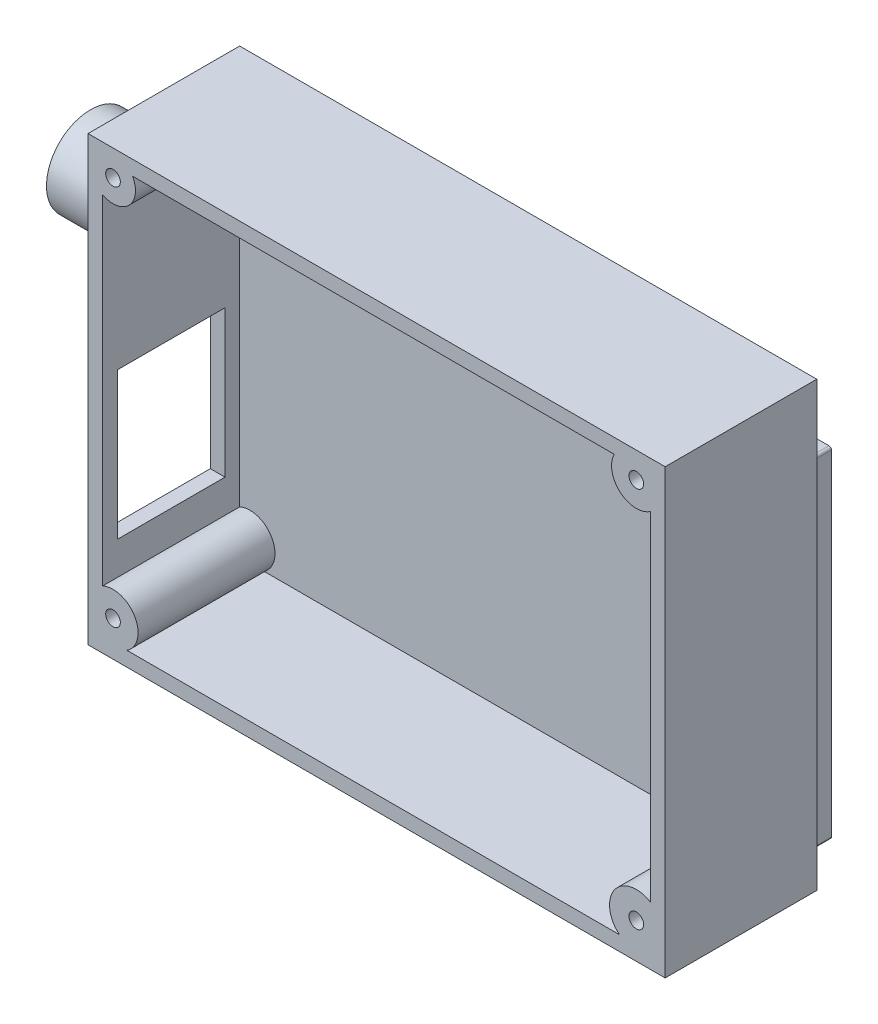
ISO-10303-21;
HEADER;
FILE_DESCRIPTION(('STEP AP214'),'2;1');
FILE_NAME('part.step','',(''),(''),'','','');
FILE_SCHEMA(('AUTOMOTIVE_DESIGN { 1 0 10303 214 1 1 1 1 }'));
ENDSEC;
DATA;
#1=APPLICATION_CONTEXT('core data for automotive mechanical design processes');
#2=APPLICATION_PROTOCOL_DEFINITION('international standard','automotive_design',2000,#1);
#3=PRODUCT_CONTEXT('',#1,'mechanical');
#4=PRODUCT('Part','Part','',(#3));
#5=PRODUCT_RELATED_PRODUCT_CATEGORY('part','',(#4));
#6=PRODUCT_DEFINITION_FORMATION('','',#4);
#7=PRODUCT_DEFINITION_CONTEXT('part definition',#1,'design');
#8=PRODUCT_DEFINITION('design','',#6,#7);
#9=PRODUCT_DEFINITION_SHAPE('','',#8);
#10=(LENGTH_UNIT() NAMED_UNIT(*) SI_UNIT(.MILLI.,.METRE.));
#11=(NAMED_UNIT(*) PLANE_ANGLE_UNIT() SI_UNIT($,.RADIAN.));
#12=(NAMED_UNIT(*) SI_UNIT($,.STERADIAN.) SOLID_ANGLE_UNIT());
#13=UNCERTAINTY_MEASURE_WITH_UNIT(LENGTH_MEASURE(1.E-05),#10,'distance_accuracy_value','');
#14=(GEOMETRIC_REPRESENTATION_CONTEXT(3) GLOBAL_UNCERTAINTY_ASSIGNED_CONTEXT((#13)) GLOBAL_UNIT_ASSIGNED_CONTEXT((#10,
#11,#12)) REPRESENTATION_CONTEXT('',''));
#15=CARTESIAN_POINT('',(0.,0.,0.));
#16=DIRECTION('',(0.,0.,1.));
#17=DIRECTION('',(1.,0.,0.));
#18=AXIS2_PLACEMENT_3D('',#15,#16,#17);
#19=CARTESIAN_POINT('',(-118.,0.,0.));
#20=DIRECTION('',(-1.,0.,0.));
#21=DIRECTION('',(0.,0.,1.));
#22=AXIS2_PLACEMENT_3D('',#19,#20,#21);
#23=PLANE('',#22);
#24=CARTESIAN_POINT('',(-118.,67.575,18.));
#25=DIRECTION('',(1.,0.,0.));
#26=DIRECTION('',(0.,0.,-1.));
#27=AXIS2_PLACEMENT_3D('',#24,#25,#26);
#28=CIRCLE('',#27,5.5);
#29=CARTESIAN_POINT('',(-118.,67.575,12.5));
#30=VERTEX_POINT('',#29);
#31=EDGE_CURVE('E413',#30,#30,#28,.F.);
#32=ORIENTED_EDGE('',*,*,#31,.T.);
#33=EDGE_LOOP('',(#32));
#34=FACE_BOUND('',#33,.T.);
#35=ADVANCED_FACE('F32',(#34),#23,.T.);
#36=CARTESIAN_POINT('',(0.,0.,15.));
#37=DIRECTION('',(0.,0.,1.));
#38=DIRECTION('',(1.,0.,0.));
#39=AXIS2_PLACEMENT_3D('',#36,#37,#38);
#40=PLANE('',#39);
#41=CARTESIAN_POINT('',(-112.8950577,5.828677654,15.));
#42=DIRECTION('',(0.,0.,1.));
#43=DIRECTION('',(1.,0.,0.));
#44=AXIS2_PLACEMENT_3D('',#41,#42,#43);
#45=CIRCLE('',#44,1.5);
#46=CARTESIAN_POINT('',(-111.3950577,5.828677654,15.));
#47=VERTEX_POINT('',#46);
#48=EDGE_CURVE('E410',#47,#47,#45,.T.);
#49=ORIENTED_EDGE('',*,*,#48,.T.);
#50=EDGE_LOOP('',(#49));
#51=FACE_BOUND('',#50,.T.);
#52=ADVANCED_FACE('F648',(#51),#40,.T.);
#53=CARTESIAN_POINT('',(0.,0.,15.));
#54=DIRECTION('',(0.,0.,1.));
#55=DIRECTION('',(1.,0.,0.));
#56=AXIS2_PLACEMENT_3D('',#53,#54,#55);
#57=PLANE('',#56);
#58=CARTESIAN_POINT('',(-5.895057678,83.82867765,15.));
#59=DIRECTION('',(0.,0.,1.));
#60=DIRECTION('',(1.,0.,0.));
#61=AXIS2_PLACEMENT_3D('',#58,#59,#60);
#62=CIRCLE('',#61,1.5);
#63=CARTESIAN_POINT('',(-4.395057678,83.82867765,15.));
#64=VERTEX_POINT('',#63);
#65=EDGE_CURVE('E407',#64,#64,#62,.T.);
#66=ORIENTED_EDGE('',*,*,#65,.T.);
#67=EDGE_LOOP('',(#66));
#68=FACE_BOUND('',#67,.T.);
#69=ADVANCED_FACE('F652',(#68),#57,.T.);
#70=CARTESIAN_POINT('',(0.,0.,15.));
#71=DIRECTION('',(0.,0.,1.));
#72=DIRECTION('',(1.,0.,0.));
#73=AXIS2_PLACEMENT_3D('',#70,#71,#72);
#74=PLANE('',#73);
#75=CARTESIAN_POINT('',(-112.8950577,83.82867765,15.));
#76=DIRECTION('',(0.,0.,1.));
#77=DIRECTION('',(1.,0.,0.));
#78=AXIS2_PLACEMENT_3D('',#75,#76,#77);
#79=CIRCLE('',#78,1.5);
#80=CARTESIAN_POINT('',(-111.3950577,83.82867765,15.));
#81=VERTEX_POINT('',#80);
#82=EDGE_CURVE('E369',#81,#81,#79,.T.);
#83=ORIENTED_EDGE('',*,*,#82,.T.);
#84=EDGE_LOOP('',(#83));
#85=FACE_BOUND('',#84,.T.);
#86=ADVANCED_FACE('F656',(#85),#74,.T.);
#87=CARTESIAN_POINT('',(0.,0.,15.));
#88=DIRECTION('',(0.,0.,1.));
#89=DIRECTION('',(1.,0.,0.));
#90=AXIS2_PLACEMENT_3D('',#87,#88,#89);
#91=PLANE('',#90);
#92=CARTESIAN_POINT('',(-5.895057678,5.828677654,15.));
#93=DIRECTION('',(0.,0.,1.));
#94=DIRECTION('',(1.,0.,0.));
#95=AXIS2_PLACEMENT_3D('',#92,#93,#94);
#96=CIRCLE('',#95,1.5);
#97=CARTESIAN_POINT('',(-4.395057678,5.828677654,15.));
#98=VERTEX_POINT('',#97);
#99=EDGE_CURVE('E398',#98,#98,#96,.T.);
#100=ORIENTED_EDGE('',*,*,#99,.T.);
#101=EDGE_LOOP('',(#100));
#102=FACE_BOUND('',#101,.T.);
#103=ADVANCED_FACE('F660',(#102),#91,.T.);
#104=CARTESIAN_POINT('',(-134.5,67.575,18.));
#105=DIRECTION('',(1.,0.,0.));
#106=DIRECTION('',(0.,0.,-1.));
#107=AXIS2_PLACEMENT_3D('',#104,#105,#106);
#108=CYLINDRICAL_SURFACE('',#107,5.5);
#109=CARTESIAN_POINT('',(-134.5,67.575,18.));
#110=DIRECTION('',(1.,0.,0.));
#111=DIRECTION('',(0.,0.,-1.));
#112=AXIS2_PLACEMENT_3D('',#109,#110,#111);
#113=CIRCLE('',#112,5.5);
#114=CARTESIAN_POINT('',(-134.5,67.575,12.5));
#115=VERTEX_POINT('',#114);
#116=EDGE_CURVE('E354',#115,#115,#113,.F.);
#117=ORIENTED_EDGE('',*,*,#116,.T.);
#118=EDGE_LOOP('',(#117));
#119=FACE_BOUND('',#118,.T.);
#120=ORIENTED_EDGE('',*,*,#31,.F.);
#121=EDGE_LOOP('',(#120));
#122=FACE_BOUND('',#121,.T.);
#123=ADVANCED_FACE('F664',(#119,#122),#108,.F.);
#124=CARTESIAN_POINT('',(0.,0.,7.));
#125=DIRECTION('',(0.,0.,-1.));
#126=DIRECTION('',(-1.,0.,0.));
#127=AXIS2_PLACEMENT_3D('',#124,#125,#126);
#128=PLANE('',#127);
#129=CARTESIAN_POINT('',(-5.895057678,5.828677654,7.));
#130=DIRECTION('',(0.,0.,-1.));
#131=DIRECTION('',(-1.,0.,0.));
#132=AXIS2_PLACEMENT_3D('',#129,#130,#131);
#133=CIRCLE('',#132,5.481741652);
#134=CARTESIAN_POINT('',(-9.35276183,1.575,7.));
#135=VERTEX_POINT('',#134);
#136=CARTESIAN_POINT('',(-3.,10.4835817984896,7.));
#137=VERTEX_POINT('',#136);
#138=EDGE_CURVE('E338',#135,#137,#133,.T.);
#139=ORIENTED_EDGE('',*,*,#138,.T.);
#140=DIRECTION('',(0.,1.,0.));
#141=VECTOR('',#140,1.);
#142=CARTESIAN_POINT('',(-3.,0.,7.));
#143=LINE('',#142,#141);
#144=CARTESIAN_POINT('',(-3.,79.67727759,7.));
#145=VERTEX_POINT('',#144);
#146=EDGE_CURVE('E334',#137,#145,#143,.T.);
#147=ORIENTED_EDGE('',*,*,#146,.T.);
#148=CARTESIAN_POINT('',(-5.895057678,83.82867765,7.));
#149=DIRECTION('',(0.,0.,-1.));
#150=DIRECTION('',(-1.,0.,0.));
#151=AXIS2_PLACEMENT_3D('',#148,#149,#150);
#152=CIRCLE('',#151,5.061173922);
#153=CARTESIAN_POINT('',(-10.4155020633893,86.10487272,7.));
#154=VERTEX_POINT('',#153);
#155=EDGE_CURVE('E363',#145,#154,#152,.T.);
#156=ORIENTED_EDGE('',*,*,#155,.T.);
#157=DIRECTION('',(1.,0.,0.));
#158=VECTOR('',#157,1.);
#159=CARTESIAN_POINT('',(0.,86.10487272,7.));
#160=LINE('',#159,#158);
#161=CARTESIAN_POINT('',(-108.901465,86.10487272,7.));
#162=VERTEX_POINT('',#161);
#163=EDGE_CURVE('E359',#154,#162,#160,.F.);
#164=ORIENTED_EDGE('',*,*,#163,.T.);
#165=CARTESIAN_POINT('',(-112.8950577,83.82867765,7.));
#166=DIRECTION('',(0.,0.,-1.));
#167=DIRECTION('',(-1.,0.,0.));
#168=AXIS2_PLACEMENT_3D('',#165,#166,#167);
#169=CIRCLE('',#168,4.5967213);
#170=CARTESIAN_POINT('',(-115.,79.7422287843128,7.));
#171=VERTEX_POINT('',#170);
#172=EDGE_CURVE('E358',#162,#171,#169,.T.);
#173=ORIENTED_EDGE('',*,*,#172,.T.);
#174=DIRECTION('',(0.,-1.,0.));
#175=VECTOR('',#174,1.);
#176=CARTESIAN_POINT('',(-115.,0.,7.));
#177=LINE('',#176,#175);
#178=CARTESIAN_POINT('',(-115.,10.49935057,7.));
#179=VERTEX_POINT('',#178);
#180=EDGE_CURVE('E350',#171,#179,#177,.T.);
#181=ORIENTED_EDGE('',*,*,#180,.T.);
#182=CARTESIAN_POINT('',(-112.8950577,5.828677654,7.));
#183=DIRECTION('',(0.,0.,-1.));
#184=DIRECTION('',(-1.,0.,0.));
#185=AXIS2_PLACEMENT_3D('',#182,#183,#184);
#186=CIRCLE('',#185,5.12308190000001);
#187=CARTESIAN_POINT('',(-110.039852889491,1.575,7.));
#188=VERTEX_POINT('',#187);
#189=EDGE_CURVE('E346',#179,#188,#186,.T.);
#190=ORIENTED_EDGE('',*,*,#189,.T.);
#191=DIRECTION('',(1.,0.,0.));
#192=VECTOR('',#191,1.);
#193=CARTESIAN_POINT('',(0.,1.575,7.));
#194=LINE('',#193,#192);
#195=EDGE_CURVE('E342',#188,#135,#194,.T.);
#196=ORIENTED_EDGE('',*,*,#195,.T.);
#197=EDGE_LOOP('',(#139,#147,#156,#164,#173,#181,#190,#196));
#198=FACE_BOUND('',#197,.T.);
#199=ADVANCED_FACE('F668',(#198),#128,.F.);
#200=CARTESIAN_POINT('',(-112.8950577,5.828677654,15.));
#201=DIRECTION('',(0.,0.,1.));
#202=DIRECTION('',(1.,0.,0.));
#203=AXIS2_PLACEMENT_3D('',#200,#201,#202);
#204=CYLINDRICAL_SURFACE('',#203,1.5);
#205=ORIENTED_EDGE('',*,*,#48,.F.);
#206=EDGE_LOOP('',(#205));
#207=FACE_BOUND('',#206,.T.);
#208=CARTESIAN_POINT('',(-112.8950577,5.828677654,35.));
#209=DIRECTION('',(0.,0.,1.));
#210=DIRECTION('',(1.,0.,0.));
#211=AXIS2_PLACEMENT_3D('',#208,#209,#210);
#212=CIRCLE('',#211,1.5);
#213=CARTESIAN_POINT('',(-111.3950577,5.828677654,35.));
#214=VERTEX_POINT('',#213);
#215=EDGE_CURVE('E390',#214,#214,#212,.T.);
#216=ORIENTED_EDGE('',*,*,#215,.T.);
#217=EDGE_LOOP('',(#216));
#218=FACE_BOUND('',#217,.T.);
#219=ADVANCED_FACE('F672',(#207,#218),#204,.F.);
#220=CARTESIAN_POINT('',(-5.895057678,83.82867765,15.));
#221=DIRECTION('',(0.,0.,1.));
#222=DIRECTION('',(1.,0.,0.));
#223=AXIS2_PLACEMENT_3D('',#220,#221,#222);
#224=CYLINDRICAL_SURFACE('',#223,1.5);
#225=ORIENTED_EDGE('',*,*,#65,.F.);
#226=EDGE_LOOP('',(#225));
#227=FACE_BOUND('',#226,.T.);
#228=CARTESIAN_POINT('',(-5.89505767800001,83.82867765,35.));
#229=DIRECTION('',(0.,0.,1.));
#230=DIRECTION('',(1.,0.,0.));
#231=AXIS2_PLACEMENT_3D('',#228,#229,#230);
#232=CIRCLE('',#231,1.5);
#233=CARTESIAN_POINT('',(-4.39505767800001,83.82867765,35.));
#234=VERTEX_POINT('',#233);
#235=EDGE_CURVE('E387',#234,#234,#232,.T.);
#236=ORIENTED_EDGE('',*,*,#235,.T.);
#237=EDGE_LOOP('',(#236));
#238=FACE_BOUND('',#237,.T.);
#239=ADVANCED_FACE('F676',(#227,#238),#224,.F.);
#240=CARTESIAN_POINT('',(-5.895057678,83.82867765,35.));
#241=DIRECTION('',(0.,0.,-1.));
#242=DIRECTION('',(-1.,0.,0.));
#243=AXIS2_PLACEMENT_3D('',#240,#241,#242);
#244=CYLINDRICAL_SURFACE('',#243,5.061173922);
#245=CARTESIAN_POINT('',(-5.895057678,83.82867765,35.));
#246=DIRECTION('',(0.,0.,-1.));
#247=DIRECTION('',(-1.,0.,0.));
#248=AXIS2_PLACEMENT_3D('',#245,#246,#247);
#249=CIRCLE('',#248,5.061173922);
#250=CARTESIAN_POINT('',(-3.,79.67727759,35.));
#251=VERTEX_POINT('',#250);
#252=CARTESIAN_POINT('',(-10.4155020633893,86.10487272,35.));
#253=VERTEX_POINT('',#252);
#254=EDGE_CURVE('E314',#251,#253,#249,.T.);
#255=ORIENTED_EDGE('',*,*,#254,.T.);
#256=DIRECTION('',(0.,0.,1.));
#257=VECTOR('',#256,1.);
#258=CARTESIAN_POINT('',(-10.41550206,86.10487272,0.));
#259=LINE('',#258,#257);
#260=EDGE_CURVE('E360',#253,#154,#259,.F.);
#261=ORIENTED_EDGE('',*,*,#260,.T.);
#262=ORIENTED_EDGE('',*,*,#155,.F.);
#263=DIRECTION('',(0.,0.,-1.));
#264=VECTOR('',#263,1.);
#265=CARTESIAN_POINT('',(-3.,79.67727759,0.));
#266=LINE('',#265,#264);
#267=EDGE_CURVE('E335',#145,#251,#266,.F.);
#268=ORIENTED_EDGE('',*,*,#267,.T.);
#269=EDGE_LOOP('',(#255,#261,#262,#268));
#270=FACE_BOUND('',#269,.T.);
#271=ADVANCED_FACE('F680',(#270),#244,.T.);
#272=CARTESIAN_POINT('',(0.,86.10487272,0.));
#273=DIRECTION('',(0.,1.,0.));
#274=DIRECTION('',(0.,0.,1.));
#275=AXIS2_PLACEMENT_3D('',#272,#273,#274);
#276=PLANE('',#275);
#277=ORIENTED_EDGE('',*,*,#260,.F.);
#278=DIRECTION('',(-1.,0.,0.));
#279=VECTOR('',#278,1.);
#280=CARTESIAN_POINT('',(0.,86.10487272,35.));
#281=LINE('',#280,#279);
#282=CARTESIAN_POINT('',(-108.901465,86.10487272,35.));
#283=VERTEX_POINT('',#282);
#284=EDGE_CURVE('E311',#253,#283,#281,.T.);
#285=ORIENTED_EDGE('',*,*,#284,.T.);
#286=DIRECTION('',(0.,0.,-1.));
#287=VECTOR('',#286,1.);
#288=CARTESIAN_POINT('',(-108.901465,86.10487272,21.));
#289=LINE('',#288,#287);
#290=EDGE_CURVE('E355',#283,#162,#289,.T.);
#291=ORIENTED_EDGE('',*,*,#290,.T.);
#292=ORIENTED_EDGE('',*,*,#163,.F.);
#293=EDGE_LOOP('',(#277,#285,#291,#292));
#294=FACE_BOUND('',#293,.T.);
#295=ADVANCED_FACE('F684',(#294),#276,.F.);
#296=CARTESIAN_POINT('',(-112.8950577,83.82867765,35.));
#297=DIRECTION('',(0.,0.,-1.));
#298=DIRECTION('',(-1.,0.,0.));
#299=AXIS2_PLACEMENT_3D('',#296,#297,#298);
#300=CYLINDRICAL_SURFACE('',#299,4.5967213);
#301=CARTESIAN_POINT('',(-112.8950577,83.82867765,35.));
#302=DIRECTION('',(0.,0.,-1.));
#303=DIRECTION('',(-1.,0.,0.));
#304=AXIS2_PLACEMENT_3D('',#301,#302,#303);
#305=CIRCLE('',#304,4.5967213);
#306=CARTESIAN_POINT('',(-115.,79.7422287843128,35.));
#307=VERTEX_POINT('',#306);
#308=EDGE_CURVE('E310',#283,#307,#305,.T.);
#309=ORIENTED_EDGE('',*,*,#308,.T.);
#310=DIRECTION('',(0.,0.,1.));
#311=VECTOR('',#310,1.);
#312=CARTESIAN_POINT('',(-115.,79.74222882,0.));
#313=LINE('',#312,#311);
#314=EDGE_CURVE('E347',#307,#171,#313,.F.);
#315=ORIENTED_EDGE('',*,*,#314,.T.);
#316=ORIENTED_EDGE('',*,*,#172,.F.);
#317=ORIENTED_EDGE('',*,*,#290,.F.);
#318=EDGE_LOOP('',(#309,#315,#316,#317));
#319=FACE_BOUND('',#318,.T.);
#320=ADVANCED_FACE('F688',(#319),#300,.T.);
#321=CARTESIAN_POINT('',(-112.8950577,5.828677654,35.));
#322=DIRECTION('',(0.,0.,-1.));
#323=DIRECTION('',(-1.,0.,0.));
#324=AXIS2_PLACEMENT_3D('',#321,#322,#323);
#325=CYLINDRICAL_SURFACE('',#324,5.12308190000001);
#326=CARTESIAN_POINT('',(-112.8950577,5.828677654,35.));
#327=DIRECTION('',(0.,0.,-1.));
#328=DIRECTION('',(-1.,0.,0.));
#329=AXIS2_PLACEMENT_3D('',#326,#327,#328);
#330=CIRCLE('',#329,5.12308190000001);
#331=CARTESIAN_POINT('',(-115.,10.49935057,35.));
#332=VERTEX_POINT('',#331);
#333=CARTESIAN_POINT('',(-110.039852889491,1.575,35.));
#334=VERTEX_POINT('',#333);
#335=EDGE_CURVE('E306',#332,#334,#330,.T.);
#336=ORIENTED_EDGE('',*,*,#335,.T.);
#337=DIRECTION('',(0.,0.,-1.));
#338=VECTOR('',#337,1.);
#339=CARTESIAN_POINT('',(-110.0398529,1.575,0.));
#340=LINE('',#339,#338);
#341=EDGE_CURVE('E343',#334,#188,#340,.T.);
#342=ORIENTED_EDGE('',*,*,#341,.T.);
#343=ORIENTED_EDGE('',*,*,#189,.F.);
#344=DIRECTION('',(0.,0.,1.));
#345=VECTOR('',#344,1.);
#346=CARTESIAN_POINT('',(-115.,10.49935057,0.));
#347=LINE('',#346,#345);
#348=EDGE_CURVE('E351',#179,#332,#347,.T.);
#349=ORIENTED_EDGE('',*,*,#348,.T.);
#350=EDGE_LOOP('',(#336,#342,#343,#349));
#351=FACE_BOUND('',#350,.T.);
#352=ADVANCED_FACE('F692',(#351),#325,.T.);
#353=CARTESIAN_POINT('',(0.,1.575,0.));
#354=DIRECTION('',(0.,-1.,0.));
#355=DIRECTION('',(0.,0.,-1.));
#356=AXIS2_PLACEMENT_3D('',#353,#354,#355);
#357=PLANE('',#356);
#358=ORIENTED_EDGE('',*,*,#341,.F.);
#359=DIRECTION('',(-1.,0.,0.));
#360=VECTOR('',#359,1.);
#361=CARTESIAN_POINT('',(0.,1.575,35.));
#362=LINE('',#361,#360);
#363=CARTESIAN_POINT('',(-9.35276183,1.575,35.));
#364=VERTEX_POINT('',#363);
#365=EDGE_CURVE('E303',#334,#364,#362,.F.);
#366=ORIENTED_EDGE('',*,*,#365,.T.);
#367=DIRECTION('',(0.,0.,-1.));
#368=VECTOR('',#367,1.);
#369=CARTESIAN_POINT('',(-9.35276183,1.575,21.));
#370=LINE('',#369,#368);
#371=EDGE_CURVE('E339',#364,#135,#370,.T.);
#372=ORIENTED_EDGE('',*,*,#371,.T.);
#373=ORIENTED_EDGE('',*,*,#195,.F.);
#374=EDGE_LOOP('',(#358,#366,#372,#373));
#375=FACE_BOUND('',#374,.T.);
#376=ADVANCED_FACE('F696',(#375),#357,.F.);
#377=CARTESIAN_POINT('',(-5.895057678,5.828677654,35.));
#378=DIRECTION('',(0.,0.,-1.));
#379=DIRECTION('',(-1.,0.,0.));
#380=AXIS2_PLACEMENT_3D('',#377,#378,#379);
#381=CYLINDRICAL_SURFACE('',#380,5.481741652);
#382=CARTESIAN_POINT('',(-5.895057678,5.828677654,35.));
#383=DIRECTION('',(0.,0.,-1.));
#384=DIRECTION('',(-1.,0.,0.));
#385=AXIS2_PLACEMENT_3D('',#382,#383,#384);
#386=CIRCLE('',#385,5.481741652);
#387=CARTESIAN_POINT('',(-3.,10.4835817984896,35.));
#388=VERTEX_POINT('',#387);
#389=EDGE_CURVE('E302',#364,#388,#386,.T.);
#390=ORIENTED_EDGE('',*,*,#389,.T.);
#391=DIRECTION('',(0.,0.,-1.));
#392=VECTOR('',#391,1.);
#393=CARTESIAN_POINT('',(-3.,10.4835818,0.));
#394=LINE('',#393,#392);
#395=EDGE_CURVE('E331',#388,#137,#394,.T.);
#396=ORIENTED_EDGE('',*,*,#395,.T.);
#397=ORIENTED_EDGE('',*,*,#138,.F.);
#398=ORIENTED_EDGE('',*,*,#371,.F.);
#399=EDGE_LOOP('',(#390,#396,#397,#398));
#400=FACE_BOUND('',#399,.T.);
#401=ADVANCED_FACE('F700',(#400),#381,.T.);
#402=CARTESIAN_POINT('',(-3.,0.,0.));
#403=DIRECTION('',(1.,0.,0.));
#404=DIRECTION('',(0.,0.,-1.));
#405=AXIS2_PLACEMENT_3D('',#402,#403,#404);
#406=PLANE('',#405);
#407=ORIENTED_EDGE('',*,*,#395,.F.);
#408=DIRECTION('',(0.,1.,0.));
#409=VECTOR('',#408,1.);
#410=CARTESIAN_POINT('',(-3.,0.,35.));
#411=LINE('',#410,#409);
#412=EDGE_CURVE('E298',#388,#251,#411,.T.);
#413=ORIENTED_EDGE('',*,*,#412,.T.);
#414=ORIENTED_EDGE('',*,*,#267,.F.);
#415=ORIENTED_EDGE('',*,*,#146,.F.);
#416=EDGE_LOOP('',(#407,#413,#414,#415));
#417=FACE_BOUND('',#416,.T.);
#418=ADVANCED_FACE('F704',(#417),#406,.F.);
#419=CARTESIAN_POINT('',(-112.8950577,83.82867765,15.));
#420=DIRECTION('',(0.,0.,1.));
#421=DIRECTION('',(1.,0.,0.));
#422=AXIS2_PLACEMENT_3D('',#419,#420,#421);
#423=CYLINDRICAL_SURFACE('',#422,1.5);
#424=ORIENTED_EDGE('',*,*,#82,.F.);
#425=EDGE_LOOP('',(#424));
#426=FACE_BOUND('',#425,.T.);
#427=CARTESIAN_POINT('',(-112.8950577,83.82867765,35.));
#428=DIRECTION('',(0.,0.,1.));
#429=DIRECTION('',(1.,0.,0.));
#430=AXIS2_PLACEMENT_3D('',#427,#428,#429);
#431=CIRCLE('',#430,1.5);
#432=CARTESIAN_POINT('',(-111.3950577,83.82867765,35.));
#433=VERTEX_POINT('',#432);
#434=EDGE_CURVE('E301',#433,#433,#431,.T.);
#435=ORIENTED_EDGE('',*,*,#434,.T.);
#436=EDGE_LOOP('',(#435));
#437=FACE_BOUND('',#436,.T.);
#438=ADVANCED_FACE('F708',(#426,#437),#423,.F.);
#439=CARTESIAN_POINT('',(-5.895057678,5.828677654,15.));
#440=DIRECTION('',(0.,0.,1.));
#441=DIRECTION('',(1.,0.,0.));
#442=AXIS2_PLACEMENT_3D('',#439,#440,#441);
#443=CYLINDRICAL_SURFACE('',#442,1.5);
#444=ORIENTED_EDGE('',*,*,#99,.F.);
#445=EDGE_LOOP('',(#444));
#446=FACE_BOUND('',#445,.T.);
#447=CARTESIAN_POINT('',(-5.89505767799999,5.828677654,35.));
#448=DIRECTION('',(0.,0.,1.));
#449=DIRECTION('',(1.,0.,0.));
#450=AXIS2_PLACEMENT_3D('',#447,#448,#449);
#451=CIRCLE('',#450,1.5);
#452=CARTESIAN_POINT('',(-4.39505767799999,5.828677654,35.));
#453=VERTEX_POINT('',#452);
#454=EDGE_CURVE('E378',#453,#453,#451,.T.);
#455=ORIENTED_EDGE('',*,*,#454,.T.);
#456=EDGE_LOOP('',(#455));
#457=FACE_BOUND('',#456,.T.);
#458=ADVANCED_FACE('F712',(#446,#457),#443,.F.);
#459=CARTESIAN_POINT('',(-134.5,0.,0.));
#460=DIRECTION('',(1.,0.,0.));
#461=DIRECTION('',(0.,0.,-1.));
#462=AXIS2_PLACEMENT_3D('',#459,#460,#461);
#463=PLANE('',#462);
#464=ORIENTED_EDGE('',*,*,#116,.F.);
#465=EDGE_LOOP('',(#464));
#466=FACE_BOUND('',#465,.T.);
#467=CARTESIAN_POINT('',(-134.5,67.575,18.));
#468=DIRECTION('',(1.,0.,0.));
#469=DIRECTION('',(0.,0.,-1.));
#470=AXIS2_PLACEMENT_3D('',#467,#468,#469);
#471=CIRCLE('',#470,9.);
#472=CARTESIAN_POINT('',(-134.5,67.575,9.));
#473=VERTEX_POINT('',#472);
#474=EDGE_CURVE('E297',#473,#473,#471,.F.);
#475=ORIENTED_EDGE('',*,*,#474,.T.);
#476=EDGE_LOOP('',(#475));
#477=FACE_BOUND('',#476,.T.);
#478=ADVANCED_FACE('F716',(#466,#477),#463,.F.);
#479=CARTESIAN_POINT('',(-115.,0.,0.));
#480=DIRECTION('',(-1.,0.,0.));
#481=DIRECTION('',(0.,-1.,0.));
#482=AXIS2_PLACEMENT_3D('',#479,#480,#481);
#483=PLANE('',#482);
#484=DIRECTION('',(0.,0.,-1.));
#485=VECTOR('',#484,1.);
#486=CARTESIAN_POINT('',(-115.,47.25941139,0.));
#487=LINE('',#486,#485);
#488=CARTESIAN_POINT('',(-115.,47.25941139,32.));
#489=VERTEX_POINT('',#488);
#490=CARTESIAN_POINT('',(-115.,47.25941139,10.));
#491=VERTEX_POINT('',#490);
#492=EDGE_CURVE('E290',#489,#491,#487,.T.);
#493=ORIENTED_EDGE('',*,*,#492,.T.);
#494=DIRECTION('',(0.,1.,0.));
#495=VECTOR('',#494,1.);
#496=CARTESIAN_POINT('',(-115.,0.,10.));
#497=LINE('',#496,#495);
#498=CARTESIAN_POINT('',(-115.,17.25941139,10.));
#499=VERTEX_POINT('',#498);
#500=EDGE_CURVE('E226',#491,#499,#497,.F.);
#501=ORIENTED_EDGE('',*,*,#500,.T.);
#502=DIRECTION('',(0.,0.,1.));
#503=VECTOR('',#502,1.);
#504=CARTESIAN_POINT('',(-115.,17.25941139,0.));
#505=LINE('',#504,#503);
#506=CARTESIAN_POINT('',(-115.,17.25941139,32.));
#507=VERTEX_POINT('',#506);
#508=EDGE_CURVE('E225',#499,#507,#505,.T.);
#509=ORIENTED_EDGE('',*,*,#508,.T.);
#510=DIRECTION('',(0.,1.,0.));
#511=VECTOR('',#510,1.);
#512=CARTESIAN_POINT('',(-115.,0.,32.));
#513=LINE('',#512,#511);
#514=EDGE_CURVE('E295',#507,#489,#513,.T.);
#515=ORIENTED_EDGE('',*,*,#514,.T.);
#516=EDGE_LOOP('',(#493,#501,#509,#515));
#517=FACE_BOUND('',#516,.T.);
#518=ORIENTED_EDGE('',*,*,#314,.F.);
#519=DIRECTION('',(0.,1.,0.));
#520=VECTOR('',#519,1.);
#521=CARTESIAN_POINT('',(-115.,0.,35.));
#522=LINE('',#521,#520);
#523=EDGE_CURVE('E307',#307,#332,#522,.F.);
#524=ORIENTED_EDGE('',*,*,#523,.T.);
#525=ORIENTED_EDGE('',*,*,#348,.F.);
#526=ORIENTED_EDGE('',*,*,#180,.F.);
#527=EDGE_LOOP('',(#518,#524,#525,#526));
#528=FACE_BOUND('',#527,.T.);
#529=ADVANCED_FACE('F720',(#517,#528),#483,.F.);
#530=CARTESIAN_POINT('',(-112.8950577,5.828677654,35.));
#531=DIRECTION('',(0.,0.,-1.));
#532=DIRECTION('',(-1.,0.,0.));
#533=AXIS2_PLACEMENT_3D('',#530,#531,#532);
#534=CYLINDRICAL_SURFACE('',#533,5.12308180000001);
#535=CARTESIAN_POINT('',(-112.8950577,5.828677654,4.));
#536=DIRECTION('',(0.,0.,-1.));
#537=DIRECTION('',(-1.,0.,0.));
#538=AXIS2_PLACEMENT_3D('',#535,#536,#537);
#539=CIRCLE('',#538,5.12308180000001);
#540=CARTESIAN_POINT('',(-118.,5.397943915,4.));
#541=VERTEX_POINT('',#540);
#542=CARTESIAN_POINT('',(-118.,6.25941121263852,4.));
#543=VERTEX_POINT('',#542);
#544=EDGE_CURVE('E366',#541,#543,#539,.T.);
#545=ORIENTED_EDGE('',*,*,#544,.F.);
#546=DIRECTION('',(0.,0.,1.));
#547=VECTOR('',#546,1.);
#548=CARTESIAN_POINT('',(-118.,5.397943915,0.));
#549=LINE('',#548,#547);
#550=CARTESIAN_POINT('',(-118.,5.397943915,35.));
#551=VERTEX_POINT('',#550);
#552=EDGE_CURVE('E282',#541,#551,#549,.T.);
#553=ORIENTED_EDGE('',*,*,#552,.T.);
#554=CARTESIAN_POINT('',(-112.8950577,5.828677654,35.));
#555=DIRECTION('',(0.,0.,-1.));
#556=DIRECTION('',(-1.,0.,0.));
#557=AXIS2_PLACEMENT_3D('',#554,#555,#556);
#558=CIRCLE('',#557,5.12308180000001);
#559=CARTESIAN_POINT('',(-118.,6.25941121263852,35.));
#560=VERTEX_POINT('',#559);
#561=EDGE_CURVE('E393',#551,#560,#558,.T.);
#562=ORIENTED_EDGE('',*,*,#561,.T.);
#563=DIRECTION('',(0.,0.,1.));
#564=VECTOR('',#563,1.);
#565=CARTESIAN_POINT('',(-118.,6.259411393,0.));
#566=LINE('',#565,#564);
#567=EDGE_CURVE('E242',#560,#543,#566,.F.);
#568=ORIENTED_EDGE('',*,*,#567,.T.);
#569=EDGE_LOOP('',(#545,#553,#562,#568));
#570=FACE_BOUND('',#569,.T.);
#571=ADVANCED_FACE('F500',(#570),#534,.T.);
#572=CARTESIAN_POINT('',(0.,0.,35.));
#573=DIRECTION('',(0.,0.,-1.));
#574=DIRECTION('',(-1.,0.,0.));
#575=AXIS2_PLACEMENT_3D('',#572,#573,#574);
#576=PLANE('',#575);
#577=ORIENTED_EDGE('',*,*,#454,.F.);
#578=EDGE_LOOP('',(#577));
#579=FACE_BOUND('',#578,.T.);
#580=ORIENTED_EDGE('',*,*,#434,.F.);
#581=EDGE_LOOP('',(#580));
#582=FACE_BOUND('',#581,.T.);
#583=ORIENTED_EDGE('',*,*,#389,.F.);
#584=ORIENTED_EDGE('',*,*,#365,.F.);
#585=ORIENTED_EDGE('',*,*,#335,.F.);
#586=ORIENTED_EDGE('',*,*,#523,.F.);
#587=ORIENTED_EDGE('',*,*,#308,.F.);
#588=ORIENTED_EDGE('',*,*,#284,.F.);
#589=ORIENTED_EDGE('',*,*,#254,.F.);
#590=ORIENTED_EDGE('',*,*,#412,.F.);
#591=EDGE_LOOP('',(#583,#584,#585,#586,#587,#588,#589,#590));
#592=FACE_BOUND('',#591,.T.);
#593=ORIENTED_EDGE('',*,*,#235,.F.);
#594=EDGE_LOOP('',(#593));
#595=FACE_BOUND('',#594,.T.);
#596=ORIENTED_EDGE('',*,*,#215,.F.);
#597=EDGE_LOOP('',(#596));
#598=FACE_BOUND('',#597,.T.);
#599=ORIENTED_EDGE('',*,*,#561,.F.);
#600=DIRECTION('',(0.,1.,0.));
#601=VECTOR('',#600,1.);
#602=CARTESIAN_POINT('',(-118.,0.,35.));
#603=LINE('',#602,#601);
#604=CARTESIAN_POINT('',(-118.,-1.425,35.));
#605=VERTEX_POINT('',#604);
#606=EDGE_CURVE('E279',#551,#605,#603,.F.);
#607=ORIENTED_EDGE('',*,*,#606,.T.);
#608=DIRECTION('',(1.,0.,0.));
#609=VECTOR('',#608,1.);
#610=CARTESIAN_POINT('',(0.,-1.425,35.));
#611=LINE('',#610,#609);
#612=CARTESIAN_POINT('',(0.,-1.425,35.));
#613=VERTEX_POINT('',#612);
#614=EDGE_CURVE('E270',#605,#613,#611,.T.);
#615=ORIENTED_EDGE('',*,*,#614,.T.);
#616=DIRECTION('',(0.,1.,0.));
#617=VECTOR('',#616,1.);
#618=CARTESIAN_POINT('',(0.,0.,35.));
#619=LINE('',#618,#617);
#620=CARTESIAN_POINT('',(0.,89.10487272,35.));
#621=VERTEX_POINT('',#620);
#622=EDGE_CURVE('E261',#613,#621,#619,.T.);
#623=ORIENTED_EDGE('',*,*,#622,.T.);
#624=DIRECTION('',(1.,0.,0.));
#625=VECTOR('',#624,1.);
#626=CARTESIAN_POINT('',(0.,89.10487272,35.));
#627=LINE('',#626,#625);
#628=CARTESIAN_POINT('',(-118.,89.10487272,35.));
#629=VERTEX_POINT('',#628);
#630=EDGE_CURVE('E246',#621,#629,#627,.F.);
#631=ORIENTED_EDGE('',*,*,#630,.T.);
#632=DIRECTION('',(0.,1.,0.));
#633=VECTOR('',#632,1.);
#634=CARTESIAN_POINT('',(-118.,0.,35.));
#635=LINE('',#634,#633);
#636=EDGE_CURVE('E249',#629,#560,#635,.F.);
#637=ORIENTED_EDGE('',*,*,#636,.T.);
#638=EDGE_LOOP('',(#599,#607,#615,#623,#631,#637));
#639=FACE_BOUND('',#638,.T.);
#640=ADVANCED_FACE('F503',(#579,#582,#592,#595,#598,#639),#576,.F.);
#641=CARTESIAN_POINT('',(-134.5,67.575,18.));
#642=DIRECTION('',(1.,0.,0.));
#643=DIRECTION('',(0.,0.,-1.));
#644=AXIS2_PLACEMENT_3D('',#641,#642,#643);
#645=CYLINDRICAL_SURFACE('',#644,9.);
#646=ORIENTED_EDGE('',*,*,#474,.F.);
#647=EDGE_LOOP('',(#646));
#648=FACE_BOUND('',#647,.T.);
#649=CARTESIAN_POINT('',(-118.,67.575,18.));
#650=DIRECTION('',(1.,0.,0.));
#651=DIRECTION('',(0.,0.,-1.));
#652=AXIS2_PLACEMENT_3D('',#649,#650,#651);
#653=CIRCLE('',#652,9.);
#654=CARTESIAN_POINT('',(-118.,67.575,9.));
#655=VERTEX_POINT('',#654);
#656=EDGE_CURVE('E241',#655,#655,#653,.F.);
#657=ORIENTED_EDGE('',*,*,#656,.T.);
#658=EDGE_LOOP('',(#657));
#659=FACE_BOUND('',#658,.T.);
#660=ADVANCED_FACE('F729',(#648,#659),#645,.T.);
#661=CARTESIAN_POINT('',(0.,0.,32.));
#662=DIRECTION('',(0.,0.,-1.));
#663=DIRECTION('',(-1.,0.,0.));
#664=AXIS2_PLACEMENT_3D('',#661,#662,#663);
#665=PLANE('',#664);
#666=DIRECTION('',(1.,0.,0.));
#667=VECTOR('',#666,1.);
#668=CARTESIAN_POINT('',(0.,47.25941139,32.));
#669=LINE('',#668,#667);
#670=CARTESIAN_POINT('',(-118.,47.25941139,32.));
#671=VERTEX_POINT('',#670);
#672=EDGE_CURVE('E292',#671,#489,#669,.T.);
#673=ORIENTED_EDGE('',*,*,#672,.T.);
#674=ORIENTED_EDGE('',*,*,#514,.F.);
#675=DIRECTION('',(1.,0.,0.));
#676=VECTOR('',#675,1.);
#677=CARTESIAN_POINT('',(0.,17.25941139,32.));
#678=LINE('',#677,#676);
#679=CARTESIAN_POINT('',(-118.,17.25941139,32.));
#680=VERTEX_POINT('',#679);
#681=EDGE_CURVE('E285',#507,#680,#678,.F.);
#682=ORIENTED_EDGE('',*,*,#681,.T.);
#683=DIRECTION('',(0.,1.,0.));
#684=VECTOR('',#683,1.);
#685=CARTESIAN_POINT('',(-118.,0.,32.));
#686=LINE('',#685,#684);
#687=EDGE_CURVE('E230',#680,#671,#686,.T.);
#688=ORIENTED_EDGE('',*,*,#687,.T.);
#689=EDGE_LOOP('',(#673,#674,#682,#688));
#690=FACE_BOUND('',#689,.T.);
#691=ADVANCED_FACE('F733',(#690),#665,.T.);
#692=CARTESIAN_POINT('',(0.,47.25941139,0.));
#693=DIRECTION('',(0.,-1.,0.));
#694=DIRECTION('',(0.,0.,-1.));
#695=AXIS2_PLACEMENT_3D('',#692,#693,#694);
#696=PLANE('',#695);
#697=DIRECTION('',(1.,0.,0.));
#698=VECTOR('',#697,1.);
#699=CARTESIAN_POINT('',(0.,47.25941139,10.));
#700=LINE('',#699,#698);
#701=CARTESIAN_POINT('',(-118.,47.25941139,10.));
#702=VERTEX_POINT('',#701);
#703=EDGE_CURVE('E213',#702,#491,#700,.T.);
#704=ORIENTED_EDGE('',*,*,#703,.T.);
#705=ORIENTED_EDGE('',*,*,#492,.F.);
#706=ORIENTED_EDGE('',*,*,#672,.F.);
#707=DIRECTION('',(0.,0.,1.));
#708=VECTOR('',#707,1.);
#709=CARTESIAN_POINT('',(-118.,47.25941139,0.));
#710=LINE('',#709,#708);
#711=EDGE_CURVE('E218',#671,#702,#710,.F.);
#712=ORIENTED_EDGE('',*,*,#711,.T.);
#713=EDGE_LOOP('',(#704,#705,#706,#712));
#714=FACE_BOUND('',#713,.T.);
#715=ADVANCED_FACE('F737',(#714),#696,.T.);
#716=CARTESIAN_POINT('',(0.,0.,10.));
#717=DIRECTION('',(0.,0.,1.));
#718=DIRECTION('',(1.,0.,0.));
#719=AXIS2_PLACEMENT_3D('',#716,#717,#718);
#720=PLANE('',#719);
#721=DIRECTION('',(1.,0.,0.));
#722=VECTOR('',#721,1.);
#723=CARTESIAN_POINT('',(0.,17.25941139,10.));
#724=LINE('',#723,#722);
#725=CARTESIAN_POINT('',(-118.,17.25941139,10.));
#726=VERTEX_POINT('',#725);
#727=EDGE_CURVE('E210',#726,#499,#724,.T.);
#728=ORIENTED_EDGE('',*,*,#727,.T.);
#729=ORIENTED_EDGE('',*,*,#500,.F.);
#730=ORIENTED_EDGE('',*,*,#703,.F.);
#731=DIRECTION('',(0.,1.,0.));
#732=VECTOR('',#731,1.);
#733=CARTESIAN_POINT('',(-118.,0.,10.));
#734=LINE('',#733,#732);
#735=EDGE_CURVE('E206',#702,#726,#734,.F.);
#736=ORIENTED_EDGE('',*,*,#735,.T.);
#737=EDGE_LOOP('',(#728,#729,#730,#736));
#738=FACE_BOUND('',#737,.T.);
#739=ADVANCED_FACE('F208',(#738),#720,.T.);
#740=CARTESIAN_POINT('',(0.,17.25941139,0.));
#741=DIRECTION('',(0.,1.,0.));
#742=DIRECTION('',(0.,0.,1.));
#743=AXIS2_PLACEMENT_3D('',#740,#741,#742);
#744=PLANE('',#743);
#745=ORIENTED_EDGE('',*,*,#681,.F.);
#746=ORIENTED_EDGE('',*,*,#508,.F.);
#747=ORIENTED_EDGE('',*,*,#727,.F.);
#748=DIRECTION('',(0.,0.,1.));
#749=VECTOR('',#748,1.);
#750=CARTESIAN_POINT('',(-118.,17.25941139,0.));
#751=LINE('',#750,#749);
#752=EDGE_CURVE('E217',#726,#680,#751,.T.);
#753=ORIENTED_EDGE('',*,*,#752,.T.);
#754=EDGE_LOOP('',(#745,#746,#747,#753));
#755=FACE_BOUND('',#754,.T.);
#756=ADVANCED_FACE('F223',(#755),#744,.T.);
#757=CARTESIAN_POINT('',(-118.,0.,0.));
#758=DIRECTION('',(-1.,0.,0.));
#759=DIRECTION('',(0.,0.,1.));
#760=AXIS2_PLACEMENT_3D('',#757,#758,#759);
#761=PLANE('',#760);
#762=DIRECTION('',(0.,0.,-1.));
#763=VECTOR('',#762,1.);
#764=CARTESIAN_POINT('',(-118.,-1.425,0.));
#765=LINE('',#764,#763);
#766=CARTESIAN_POINT('',(-118.,-1.425,4.));
#767=VERTEX_POINT('',#766);
#768=EDGE_CURVE('E276',#767,#605,#765,.F.);
#769=ORIENTED_EDGE('',*,*,#768,.T.);
#770=ORIENTED_EDGE('',*,*,#606,.F.);
#771=ORIENTED_EDGE('',*,*,#552,.F.);
#772=DIRECTION('',(0.,1.,0.));
#773=VECTOR('',#772,1.);
#774=CARTESIAN_POINT('',(-118.,0.,4.));
#775=LINE('',#774,#773);
#776=EDGE_CURVE('E231',#541,#767,#775,.F.);
#777=ORIENTED_EDGE('',*,*,#776,.T.);
#778=EDGE_LOOP('',(#769,#770,#771,#777));
#779=FACE_BOUND('',#778,.T.);
#780=ADVANCED_FACE('F517',(#779),#761,.T.);
#781=CARTESIAN_POINT('',(0.,-1.425,0.));
#782=DIRECTION('',(0.,-1.,0.));
#783=DIRECTION('',(0.,0.,-1.));
#784=AXIS2_PLACEMENT_3D('',#781,#782,#783);
#785=PLANE('',#784);
#786=ORIENTED_EDGE('',*,*,#614,.F.);
#787=ORIENTED_EDGE('',*,*,#768,.F.);
#788=DIRECTION('',(-1.,0.,0.));
#789=VECTOR('',#788,1.);
#790=CARTESIAN_POINT('',(0.,-1.425,4.));
#791=LINE('',#790,#789);
#792=CARTESIAN_POINT('',(0.,-1.425,4.));
#793=VERTEX_POINT('',#792);
#794=EDGE_CURVE('E233',#767,#793,#791,.F.);
#795=ORIENTED_EDGE('',*,*,#794,.T.);
#796=DIRECTION('',(0.,0.,-1.));
#797=VECTOR('',#796,1.);
#798=CARTESIAN_POINT('',(0.,-1.425,0.));
#799=LINE('',#798,#797);
#800=EDGE_CURVE('E267',#793,#613,#799,.F.);
#801=ORIENTED_EDGE('',*,*,#800,.T.);
#802=EDGE_LOOP('',(#786,#787,#795,#801));
#803=FACE_BOUND('',#802,.T.);
#804=ADVANCED_FACE('F515',(#803),#785,.T.);
#805=CARTESIAN_POINT('',(0.,0.,0.));
#806=DIRECTION('',(1.,0.,0.));
#807=DIRECTION('',(0.,0.,-1.));
#808=AXIS2_PLACEMENT_3D('',#805,#806,#807);
#809=PLANE('',#808);
#810=ORIENTED_EDGE('',*,*,#622,.F.);
#811=ORIENTED_EDGE('',*,*,#800,.F.);
#812=DIRECTION('',(0.,1.,0.));
#813=VECTOR('',#812,1.);
#814=CARTESIAN_POINT('',(0.,0.,4.));
#815=LINE('',#814,#813);
#816=CARTESIAN_POINT('',(0.,89.10487272,4.));
#817=VERTEX_POINT('',#816);
#818=EDGE_CURVE('E255',#793,#817,#815,.T.);
#819=ORIENTED_EDGE('',*,*,#818,.T.);
#820=DIRECTION('',(0.,0.,1.));
#821=VECTOR('',#820,1.);
#822=CARTESIAN_POINT('',(0.,89.10487272,0.));
#823=LINE('',#822,#821);
#824=EDGE_CURVE('E258',#817,#621,#823,.T.);
#825=ORIENTED_EDGE('',*,*,#824,.T.);
#826=EDGE_LOOP('',(#810,#811,#819,#825));
#827=FACE_BOUND('',#826,.T.);
#828=ADVANCED_FACE('F510',(#827),#809,.T.);
#829=CARTESIAN_POINT('',(0.,89.10487272,0.));
#830=DIRECTION('',(0.,1.,0.));
#831=DIRECTION('',(0.,0.,1.));
#832=AXIS2_PLACEMENT_3D('',#829,#830,#831);
#833=PLANE('',#832);
#834=ORIENTED_EDGE('',*,*,#630,.F.);
#835=ORIENTED_EDGE('',*,*,#824,.F.);
#836=DIRECTION('',(-1.,0.,0.));
#837=VECTOR('',#836,1.);
#838=CARTESIAN_POINT('',(0.,89.10487272,4.));
#839=LINE('',#838,#837);
#840=CARTESIAN_POINT('',(-118.,89.10487272,4.));
#841=VERTEX_POINT('',#840);
#842=EDGE_CURVE('E252',#817,#841,#839,.T.);
#843=ORIENTED_EDGE('',*,*,#842,.T.);
#844=DIRECTION('',(0.,0.,1.));
#845=VECTOR('',#844,1.);
#846=CARTESIAN_POINT('',(-118.,89.10487272,0.));
#847=LINE('',#846,#845);
#848=EDGE_CURVE('E245',#841,#629,#847,.T.);
#849=ORIENTED_EDGE('',*,*,#848,.T.);
#850=EDGE_LOOP('',(#834,#835,#843,#849));
#851=FACE_BOUND('',#850,.T.);
#852=ADVANCED_FACE('F508',(#851),#833,.T.);
#853=CARTESIAN_POINT('',(-118.,0.,0.));
#854=DIRECTION('',(-1.,0.,0.));
#855=DIRECTION('',(0.,0.,1.));
#856=AXIS2_PLACEMENT_3D('',#853,#854,#855);
#857=PLANE('',#856);
#858=ORIENTED_EDGE('',*,*,#735,.F.);
#859=ORIENTED_EDGE('',*,*,#711,.F.);
#860=ORIENTED_EDGE('',*,*,#687,.F.);
#861=ORIENTED_EDGE('',*,*,#752,.F.);
#862=EDGE_LOOP('',(#858,#859,#860,#861));
#863=FACE_BOUND('',#862,.T.);
#864=ORIENTED_EDGE('',*,*,#656,.F.);
#865=EDGE_LOOP('',(#864));
#866=FACE_BOUND('',#865,.T.);
#867=ORIENTED_EDGE('',*,*,#848,.F.);
#868=DIRECTION('',(0.,1.,0.));
#869=VECTOR('',#868,1.);
#870=CARTESIAN_POINT('',(-118.,0.,4.));
#871=LINE('',#870,#869);
#872=EDGE_CURVE('E254',#841,#543,#871,.F.);
#873=ORIENTED_EDGE('',*,*,#872,.T.);
#874=ORIENTED_EDGE('',*,*,#567,.F.);
#875=ORIENTED_EDGE('',*,*,#636,.F.);
#876=EDGE_LOOP('',(#867,#873,#874,#875));
#877=FACE_BOUND('',#876,.T.);
#878=ADVANCED_FACE('F228',(#863,#866,#877),#857,.T.);
#879=CARTESIAN_POINT('',(0.,0.,4.));
#880=DIRECTION('',(0.,0.,-1.));
#881=DIRECTION('',(-1.,0.,0.));
#882=AXIS2_PLACEMENT_3D('',#879,#880,#881);
#883=PLANE('',#882);
#884=DIRECTION('',(0.,1.,0.));
#885=VECTOR('',#884,1.);
#886=CARTESIAN_POINT('',(-83.,74.5749999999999,4.));
#887=LINE('',#886,#885);
#888=CARTESIAN_POINT('',(-83.,5.575,4.));
#889=VERTEX_POINT('',#888);
#890=CARTESIAN_POINT('',(-83.,74.0749999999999,4.));
#891=VERTEX_POINT('',#890);
#892=EDGE_CURVE('E454',#889,#891,#887,.T.);
#893=ORIENTED_EDGE('',*,*,#892,.F.);
#894=CARTESIAN_POINT('',(-82.5,5.575,4.));
#895=DIRECTION('',(0.,0.,-1.));
#896=DIRECTION('',(-1.,0.,0.));
#897=AXIS2_PLACEMENT_3D('',#894,#895,#896);
#898=CIRCLE('',#897,0.5);
#899=CARTESIAN_POINT('',(-82.5,5.075,4.));
#900=VERTEX_POINT('',#899);
#901=EDGE_CURVE('E40',#889,#900,#898,.F.);
#902=ORIENTED_EDGE('',*,*,#901,.T.);
#903=DIRECTION('',(1.,0.,0.));
#904=VECTOR('',#903,1.);
#905=CARTESIAN_POINT('',(0.,5.075,4.));
#906=LINE('',#905,#904);
#907=CARTESIAN_POINT('',(-1.5,5.075,4.));
#908=VERTEX_POINT('',#907);
#909=EDGE_CURVE('E236',#900,#908,#906,.T.);
#910=ORIENTED_EDGE('',*,*,#909,.T.);
#911=CARTESIAN_POINT('',(-1.5,5.575,4.));
#912=DIRECTION('',(0.,0.,-1.));
#913=DIRECTION('',(-1.,0.,0.));
#914=AXIS2_PLACEMENT_3D('',#911,#912,#913);
#915=CIRCLE('',#914,0.5);
#916=CARTESIAN_POINT('',(-1.,5.575,4.));
#917=VERTEX_POINT('',#916);
#918=EDGE_CURVE('E445',#908,#917,#915,.F.);
#919=ORIENTED_EDGE('',*,*,#918,.T.);
#920=DIRECTION('',(0.,1.,0.));
#921=VECTOR('',#920,1.);
#922=CARTESIAN_POINT('',(-1.,0.,4.));
#923=LINE('',#922,#921);
#924=CARTESIAN_POINT('',(-1.,74.0749999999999,4.));
#925=VERTEX_POINT('',#924);
#926=EDGE_CURVE('E462',#917,#925,#923,.T.);
#927=ORIENTED_EDGE('',*,*,#926,.T.);
#928=CARTESIAN_POINT('',(-1.5,74.0749999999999,4.));
#929=DIRECTION('',(0.,0.,-1.));
#930=DIRECTION('',(-1.,0.,0.));
#931=AXIS2_PLACEMENT_3D('',#928,#929,#930);
#932=CIRCLE('',#931,0.5);
#933=CARTESIAN_POINT('',(-1.5,74.5749999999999,4.));
#934=VERTEX_POINT('',#933);
#935=EDGE_CURVE('E447',#925,#934,#932,.F.);
#936=ORIENTED_EDGE('',*,*,#935,.T.);
#937=DIRECTION('',(1.,0.,0.));
#938=VECTOR('',#937,1.);
#939=CARTESIAN_POINT('',(-0.999999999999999,74.5749999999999,4.));
#940=LINE('',#939,#938);
#941=CARTESIAN_POINT('',(-82.5,74.5749999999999,4.));
#942=VERTEX_POINT('',#941);
#943=EDGE_CURVE('E416',#942,#934,#940,.T.);
#944=ORIENTED_EDGE('',*,*,#943,.F.);
#945=CARTESIAN_POINT('',(-82.5,74.0749999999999,4.));
#946=DIRECTION('',(0.,0.,-1.));
#947=DIRECTION('',(-1.,0.,0.));
#948=AXIS2_PLACEMENT_3D('',#945,#946,#947);
#949=CIRCLE('',#948,0.5);
#950=EDGE_CURVE('E11',#942,#891,#949,.F.);
#951=ORIENTED_EDGE('',*,*,#950,.T.);
#952=EDGE_LOOP('',(#893,#902,#910,#919,#927,#936,#944,#951));
#953=FACE_BOUND('',#952,.T.);
#954=ORIENTED_EDGE('',*,*,#842,.F.);
#955=ORIENTED_EDGE('',*,*,#818,.F.);
#956=ORIENTED_EDGE('',*,*,#794,.F.);
#957=ORIENTED_EDGE('',*,*,#776,.F.);
#958=ORIENTED_EDGE('',*,*,#544,.T.);
#959=ORIENTED_EDGE('',*,*,#872,.F.);
#960=EDGE_LOOP('',(#954,#955,#956,#957,#958,#959));
#961=FACE_BOUND('',#960,.T.);
#962=ADVANCED_FACE('F451',(#953,#961),#883,.T.);
#963=CARTESIAN_POINT('',(0.,5.075,0.));
#964=DIRECTION('',(0.,-1.,0.));
#965=DIRECTION('',(0.,0.,-1.));
#966=AXIS2_PLACEMENT_3D('',#963,#964,#965);
#967=PLANE('',#966);
#968=DIRECTION('',(-1.,0.,0.));
#969=VECTOR('',#968,1.);
#970=CARTESIAN_POINT('',(0.,5.075,0.));
#971=LINE('',#970,#969);
#972=CARTESIAN_POINT('',(-82.5,5.075,0.));
#973=VERTEX_POINT('',#972);
#974=CARTESIAN_POINT('',(-1.5,5.075,0.));
#975=VERTEX_POINT('',#974);
#976=EDGE_CURVE('E469',#973,#975,#971,.F.);
#977=ORIENTED_EDGE('',*,*,#976,.T.);
#978=DIRECTION('',(0.,0.,-1.));
#979=VECTOR('',#978,1.);
#980=CARTESIAN_POINT('',(-1.5,5.075,0.));
#981=LINE('',#980,#979);
#982=EDGE_CURVE('E434',#975,#908,#981,.F.);
#983=ORIENTED_EDGE('',*,*,#982,.T.);
#984=ORIENTED_EDGE('',*,*,#909,.F.);
#985=DIRECTION('',(0.,0.,-1.));
#986=VECTOR('',#985,1.);
#987=CARTESIAN_POINT('',(-82.5,5.075,0.));
#988=LINE('',#987,#986);
#989=EDGE_CURVE('E431',#900,#973,#988,.T.);
#990=ORIENTED_EDGE('',*,*,#989,.T.);
#991=EDGE_LOOP('',(#977,#983,#984,#990));
#992=FACE_BOUND('',#991,.T.);
#993=ADVANCED_FACE('F459',(#992),#967,.T.);
#994=CARTESIAN_POINT('',(-1.,0.,0.));
#995=DIRECTION('',(1.,0.,0.));
#996=DIRECTION('',(0.,0.,-1.));
#997=AXIS2_PLACEMENT_3D('',#994,#995,#996);
#998=PLANE('',#997);
#999=ORIENTED_EDGE('',*,*,#926,.F.);
#1000=DIRECTION('',(0.,0.,-1.));
#1001=VECTOR('',#1000,1.);
#1002=CARTESIAN_POINT('',(-1.,5.575,0.));
#1003=LINE('',#1002,#1001);
#1004=CARTESIAN_POINT('',(-1.,5.575,0.));
#1005=VERTEX_POINT('',#1004);
#1006=EDGE_CURVE('E419',#917,#1005,#1003,.T.);
#1007=ORIENTED_EDGE('',*,*,#1006,.T.);
#1008=DIRECTION('',(0.,1.,0.));
#1009=VECTOR('',#1008,1.);
#1010=CARTESIAN_POINT('',(-1.,0.,0.));
#1011=LINE('',#1010,#1009);
#1012=CARTESIAN_POINT('',(-1.,74.0749999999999,0.));
#1013=VERTEX_POINT('',#1012);
#1014=EDGE_CURVE('E420',#1005,#1013,#1011,.T.);
#1015=ORIENTED_EDGE('',*,*,#1014,.T.);
#1016=DIRECTION('',(0.,0.,-1.));
#1017=VECTOR('',#1016,1.);
#1018=CARTESIAN_POINT('',(-1.,74.0749999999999,4.));
#1019=LINE('',#1018,#1017);
#1020=EDGE_CURVE('E417',#1013,#925,#1019,.F.);
#1021=ORIENTED_EDGE('',*,*,#1020,.T.);
#1022=EDGE_LOOP('',(#999,#1007,#1015,#1021));
#1023=FACE_BOUND('',#1022,.T.);
#1024=ADVANCED_FACE('F528',(#1023),#998,.T.);
#1025=CARTESIAN_POINT('',(0.,0.,0.));
#1026=DIRECTION('',(0.,0.,-1.));
#1027=DIRECTION('',(-1.,0.,0.));
#1028=AXIS2_PLACEMENT_3D('',#1025,#1026,#1027);
#1029=PLANE('',#1028);
#1030=ORIENTED_EDGE('',*,*,#1014,.F.);
#1031=CARTESIAN_POINT('',(-1.5,5.575,0.));
#1032=DIRECTION('',(0.,0.,-1.));
#1033=DIRECTION('',(-1.,0.,0.));
#1034=AXIS2_PLACEMENT_3D('',#1031,#1032,#1033);
#1035=CIRCLE('',#1034,0.5);
#1036=EDGE_CURVE('E429',#1005,#975,#1035,.T.);
#1037=ORIENTED_EDGE('',*,*,#1036,.T.);
#1038=ORIENTED_EDGE('',*,*,#976,.F.);
#1039=CARTESIAN_POINT('',(-82.5,5.575,0.));
#1040=DIRECTION('',(0.,0.,-1.));
#1041=DIRECTION('',(-1.,0.,0.));
#1042=AXIS2_PLACEMENT_3D('',#1039,#1040,#1041);
#1043=CIRCLE('',#1042,0.5);
#1044=CARTESIAN_POINT('',(-83.,5.575,0.));
#1045=VERTEX_POINT('',#1044);
#1046=EDGE_CURVE('E425',#973,#1045,#1043,.T.);
#1047=ORIENTED_EDGE('',*,*,#1046,.T.);
#1048=DIRECTION('',(0.,-1.,0.));
#1049=VECTOR('',#1048,1.);
#1050=CARTESIAN_POINT('',(-83.,74.5749999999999,0.));
#1051=LINE('',#1050,#1049);
#1052=CARTESIAN_POINT('',(-83.,74.0749999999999,0.));
#1053=VERTEX_POINT('',#1052);
#1054=EDGE_CURVE('E468',#1053,#1045,#1051,.T.);
#1055=ORIENTED_EDGE('',*,*,#1054,.F.);
#1056=CARTESIAN_POINT('',(-82.5,74.0749999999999,0.));
#1057=DIRECTION('',(0.,0.,-1.));
#1058=DIRECTION('',(-1.,0.,0.));
#1059=AXIS2_PLACEMENT_3D('',#1056,#1057,#1058);
#1060=CIRCLE('',#1059,0.5);
#1061=CARTESIAN_POINT('',(-82.5,74.5749999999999,0.));
#1062=VERTEX_POINT('',#1061);
#1063=EDGE_CURVE('E423',#1053,#1062,#1060,.T.);
#1064=ORIENTED_EDGE('',*,*,#1063,.T.);
#1065=DIRECTION('',(-1.,0.,0.));
#1066=VECTOR('',#1065,1.);
#1067=CARTESIAN_POINT('',(-0.999999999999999,74.5749999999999,0.));
#1068=LINE('',#1067,#1066);
#1069=CARTESIAN_POINT('',(-1.5,74.5749999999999,0.));
#1070=VERTEX_POINT('',#1069);
#1071=EDGE_CURVE('E473',#1070,#1062,#1068,.T.);
#1072=ORIENTED_EDGE('',*,*,#1071,.F.);
#1073=CARTESIAN_POINT('',(-1.5,74.0749999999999,0.));
#1074=DIRECTION('',(0.,0.,-1.));
#1075=DIRECTION('',(-1.,0.,0.));
#1076=AXIS2_PLACEMENT_3D('',#1073,#1074,#1075);
#1077=CIRCLE('',#1076,0.5);
#1078=EDGE_CURVE('E427',#1070,#1013,#1077,.T.);
#1079=ORIENTED_EDGE('',*,*,#1078,.T.);
#1080=EDGE_LOOP('',(#1030,#1037,#1038,#1047,#1055,#1064,#1072,#1079));
#1081=FACE_BOUND('',#1080,.T.);
#1082=ADVANCED_FACE('F467',(#1081),#1029,.T.);
#1083=CARTESIAN_POINT('',(-0.999999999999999,74.5749999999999,86.8869712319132));
#1084=DIRECTION('',(0.,-1.,0.));
#1085=DIRECTION('',(0.,0.,-1.));
#1086=AXIS2_PLACEMENT_3D('',#1083,#1084,#1085);
#1087=PLANE('',#1086);
#1088=ORIENTED_EDGE('',*,*,#943,.T.);
#1089=DIRECTION('',(0.,0.,-1.));
#1090=VECTOR('',#1089,1.);
#1091=CARTESIAN_POINT('',(-1.5,74.5749999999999,0.));
#1092=LINE('',#1091,#1090);
#1093=EDGE_CURVE('E438',#934,#1070,#1092,.T.);
#1094=ORIENTED_EDGE('',*,*,#1093,.T.);
#1095=ORIENTED_EDGE('',*,*,#1071,.T.);
#1096=DIRECTION('',(0.,0.,-1.));
#1097=VECTOR('',#1096,1.);
#1098=CARTESIAN_POINT('',(-82.5,74.5749999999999,86.8869712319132));
#1099=LINE('',#1098,#1097);
#1100=EDGE_CURVE('E436',#1062,#942,#1099,.F.);
#1101=ORIENTED_EDGE('',*,*,#1100,.T.);
#1102=EDGE_LOOP('',(#1088,#1094,#1095,#1101));
#1103=FACE_BOUND('',#1102,.T.);
#1104=ADVANCED_FACE('F527',(#1103),#1087,.F.);
#1105=CARTESIAN_POINT('',(-83.,74.5749999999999,73.5017985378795));
#1106=DIRECTION('',(1.,0.,0.));
#1107=DIRECTION('',(0.,1.,0.));
#1108=AXIS2_PLACEMENT_3D('',#1105,#1106,#1107);
#1109=PLANE('',#1108);
#1110=ORIENTED_EDGE('',*,*,#1054,.T.);
#1111=DIRECTION('',(0.,0.,-1.));
#1112=VECTOR('',#1111,1.);
#1113=CARTESIAN_POINT('',(-83.,5.575,4.));
#1114=LINE('',#1113,#1112);
#1115=EDGE_CURVE('E52',#1045,#889,#1114,.F.);
#1116=ORIENTED_EDGE('',*,*,#1115,.T.);
#1117=ORIENTED_EDGE('',*,*,#892,.T.);
#1118=DIRECTION('',(0.,0.,-1.));
#1119=VECTOR('',#1118,1.);
#1120=CARTESIAN_POINT('',(-83.,74.0749999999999,73.5017985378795));
#1121=LINE('',#1120,#1119);
#1122=EDGE_CURVE('E441',#891,#1053,#1121,.T.);
#1123=ORIENTED_EDGE('',*,*,#1122,.T.);
#1124=EDGE_LOOP('',(#1110,#1116,#1117,#1123));
#1125=FACE_BOUND('',#1124,.T.);
#1126=ADVANCED_FACE('F470',(#1125),#1109,.F.);
#1127=CARTESIAN_POINT('',(-1.5,5.575,0.));
#1128=DIRECTION('',(0.,0.,-1.));
#1129=DIRECTION('',(-1.,0.,0.));
#1130=AXIS2_PLACEMENT_3D('',#1127,#1128,#1129);
#1131=CYLINDRICAL_SURFACE('',#1130,0.5);
#1132=ORIENTED_EDGE('',*,*,#918,.F.);
#1133=ORIENTED_EDGE('',*,*,#982,.F.);
#1134=ORIENTED_EDGE('',*,*,#1036,.F.);
#1135=ORIENTED_EDGE('',*,*,#1006,.F.);
#1136=EDGE_LOOP('',(#1132,#1133,#1134,#1135));
#1137=FACE_BOUND('',#1136,.T.);
#1138=ADVANCED_FACE('F601',(#1137),#1131,.T.);
#1139=CARTESIAN_POINT('',(-1.5,74.0749999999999,86.8869712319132));
#1140=DIRECTION('',(0.,0.,1.));
#1141=DIRECTION('',(1.,0.,0.));
#1142=AXIS2_PLACEMENT_3D('',#1139,#1140,#1141);
#1143=CYLINDRICAL_SURFACE('',#1142,0.5);
#1144=ORIENTED_EDGE('',*,*,#935,.F.);
#1145=ORIENTED_EDGE('',*,*,#1020,.F.);
#1146=ORIENTED_EDGE('',*,*,#1078,.F.);
#1147=ORIENTED_EDGE('',*,*,#1093,.F.);
#1148=EDGE_LOOP('',(#1144,#1145,#1146,#1147));
#1149=FACE_BOUND('',#1148,.T.);
#1150=ADVANCED_FACE('F609',(#1149),#1143,.T.);
#1151=CARTESIAN_POINT('',(-82.5,5.575,0.));
#1152=DIRECTION('',(0.,0.,1.));
#1153=DIRECTION('',(0.,-1.,0.));
#1154=AXIS2_PLACEMENT_3D('',#1151,#1152,#1153);
#1155=CYLINDRICAL_SURFACE('',#1154,0.5);
#1156=ORIENTED_EDGE('',*,*,#901,.F.);
#1157=ORIENTED_EDGE('',*,*,#1115,.F.);
#1158=ORIENTED_EDGE('',*,*,#1046,.F.);
#1159=ORIENTED_EDGE('',*,*,#989,.F.);
#1160=EDGE_LOOP('',(#1156,#1157,#1158,#1159));
#1161=FACE_BOUND('',#1160,.T.);
#1162=ADVANCED_FACE('F463',(#1161),#1155,.T.);
#1163=CARTESIAN_POINT('',(-82.5,74.0749999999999,73.5017985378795));
#1164=DIRECTION('',(0.,0.,-1.));
#1165=DIRECTION('',(-1.,0.,0.));
#1166=AXIS2_PLACEMENT_3D('',#1163,#1164,#1165);
#1167=CYLINDRICAL_SURFACE('',#1166,0.5);
#1168=ORIENTED_EDGE('',*,*,#950,.F.);
#1169=ORIENTED_EDGE('',*,*,#1100,.F.);
#1170=ORIENTED_EDGE('',*,*,#1063,.F.);
#1171=ORIENTED_EDGE('',*,*,#1122,.F.);
#1172=EDGE_LOOP('',(#1168,#1169,#1170,#1171));
#1173=FACE_BOUND('',#1172,.T.);
#1174=ADVANCED_FACE('F34',(#1173),#1167,.T.);
#1175=CLOSED_SHELL('',(#35,#52,#69,#86,#103,#123,#199,#219,#239,#271,#295,#320,#352,#376,#401,
#418,#438,#458,#478,#529,#571,#640,#660,#691,#715,#739,#756,#780,#804,#828,#852,#878,#962,#993,
#1024,#1082,#1104,#1126,#1138,#1150,#1162,#1174));
#1176=MANIFOLD_SOLID_BREP('B2',#1175);
#1177=ADVANCED_BREP_SHAPE_REPRESENTATION('',(#18,#1176),#14);
#1178=SHAPE_DEFINITION_REPRESENTATION(#9,#1177);
ENDSEC;
END-ISO-10303-21;
